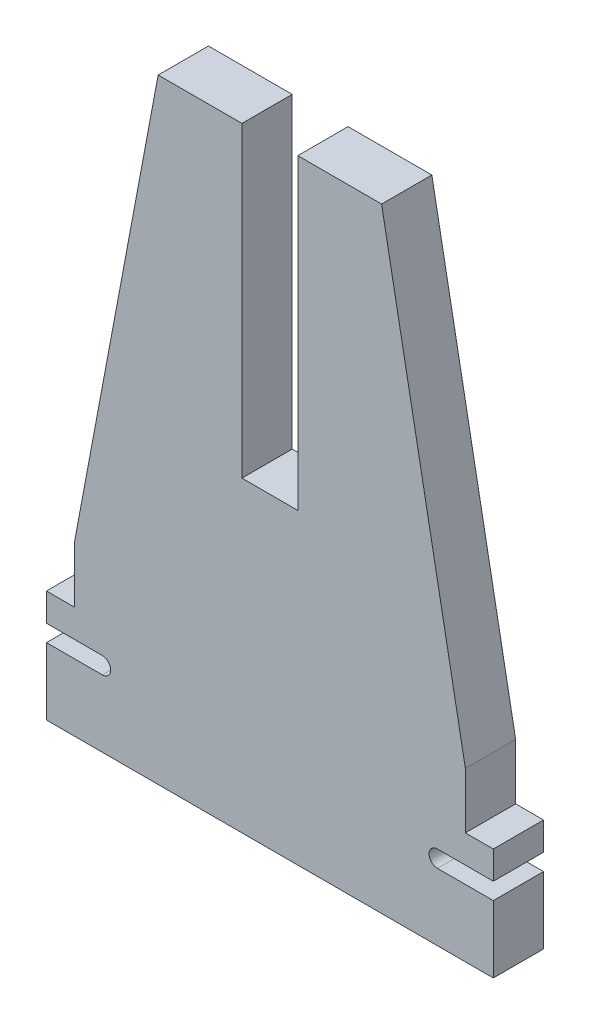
ISO-10303-21;
HEADER;
FILE_DESCRIPTION(('STEP AP214'),'2;1');
FILE_NAME('part.step','',(''),(''),'','','');
FILE_SCHEMA(('AUTOMOTIVE_DESIGN { 1 0 10303 214 1 1 1 1 }'));
ENDSEC;
DATA;
#1=APPLICATION_CONTEXT('core data for automotive mechanical design processes');
#2=APPLICATION_PROTOCOL_DEFINITION('international standard','automotive_design',2000,#1);
#3=PRODUCT_CONTEXT('',#1,'mechanical');
#4=PRODUCT('Part','Part','',(#3));
#5=PRODUCT_RELATED_PRODUCT_CATEGORY('part','',(#4));
#6=PRODUCT_DEFINITION_FORMATION('','',#4);
#7=PRODUCT_DEFINITION_CONTEXT('part definition',#1,'design');
#8=PRODUCT_DEFINITION('design','',#6,#7);
#9=PRODUCT_DEFINITION_SHAPE('','',#8);
#10=(LENGTH_UNIT() NAMED_UNIT(*) SI_UNIT(.MILLI.,.METRE.));
#11=(NAMED_UNIT(*) PLANE_ANGLE_UNIT() SI_UNIT($,.RADIAN.));
#12=(NAMED_UNIT(*) SI_UNIT($,.STERADIAN.) SOLID_ANGLE_UNIT());
#13=UNCERTAINTY_MEASURE_WITH_UNIT(LENGTH_MEASURE(1.E-05),#10,'distance_accuracy_value','');
#14=(GEOMETRIC_REPRESENTATION_CONTEXT(3) GLOBAL_UNCERTAINTY_ASSIGNED_CONTEXT((#13)) GLOBAL_UNIT_ASSIGNED_CONTEXT((#10,
#11,#12)) REPRESENTATION_CONTEXT('',''));
#15=CARTESIAN_POINT('',(0.,0.,0.));
#16=DIRECTION('',(0.,0.,1.));
#17=DIRECTION('',(1.,0.,0.));
#18=AXIS2_PLACEMENT_3D('',#15,#16,#17);
#19=CARTESIAN_POINT('',(-75.,20.,-9.));
#20=DIRECTION('',(-1.,0.,0.));
#21=DIRECTION('',(0.,0.,1.));
#22=AXIS2_PLACEMENT_3D('',#19,#20,#21);
#23=PLANE('',#22);
#24=DIRECTION('',(0.,0.,1.));
#25=VECTOR('',#24,1.);
#26=CARTESIAN_POINT('',(-75.,12.,-10.));
#27=LINE('',#26,#25);
#28=CARTESIAN_POINT('',(-75.,12.,-9.));
#29=VERTEX_POINT('',#28);
#30=CARTESIAN_POINT('',(-75.,12.,0.));
#31=VERTEX_POINT('',#30);
#32=EDGE_CURVE('E203',#29,#31,#27,.T.);
#33=ORIENTED_EDGE('',*,*,#32,.F.);
#34=DIRECTION('',(0.,-1.,0.));
#35=VECTOR('',#34,1.);
#36=CARTESIAN_POINT('',(-75.,20.,-9.));
#37=LINE('',#36,#35);
#38=CARTESIAN_POINT('',(-75.,0.,-9.));
#39=VERTEX_POINT('',#38);
#40=EDGE_CURVE('E242',#29,#39,#37,.T.);
#41=ORIENTED_EDGE('',*,*,#40,.T.);
#42=DIRECTION('',(0.,0.,1.));
#43=VECTOR('',#42,1.);
#44=CARTESIAN_POINT('',(-75.,0.,-9.));
#45=LINE('',#44,#43);
#46=CARTESIAN_POINT('',(-75.,0.,0.));
#47=VERTEX_POINT('',#46);
#48=EDGE_CURVE('E11',#39,#47,#45,.T.);
#49=ORIENTED_EDGE('',*,*,#48,.T.);
#50=DIRECTION('',(0.,-1.,0.));
#51=VECTOR('',#50,1.);
#52=CARTESIAN_POINT('',(-75.,20.,0.));
#53=LINE('',#52,#51);
#54=EDGE_CURVE('E211',#31,#47,#53,.T.);
#55=ORIENTED_EDGE('',*,*,#54,.F.);
#56=EDGE_LOOP('',(#33,#41,#49,#55));
#57=FACE_BOUND('',#56,.T.);
#58=ADVANCED_FACE('F33',(#57),#23,.T.);
#59=CARTESIAN_POINT('',(5.00000000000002,20.,-9.));
#60=DIRECTION('',(1.,0.,0.));
#61=DIRECTION('',(0.,1.,0.));
#62=AXIS2_PLACEMENT_3D('',#59,#60,#61);
#63=PLANE('',#62);
#64=DIRECTION('',(0.,0.,1.));
#65=VECTOR('',#64,1.);
#66=CARTESIAN_POINT('',(5.00000000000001,12.,-10.));
#67=LINE('',#66,#65);
#68=CARTESIAN_POINT('',(5.00000000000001,12.,-9.));
#69=VERTEX_POINT('',#68);
#70=CARTESIAN_POINT('',(5.00000000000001,12.,0.));
#71=VERTEX_POINT('',#70);
#72=EDGE_CURVE('E301',#69,#71,#67,.T.);
#73=ORIENTED_EDGE('',*,*,#72,.T.);
#74=DIRECTION('',(0.,1.,0.));
#75=VECTOR('',#74,1.);
#76=CARTESIAN_POINT('',(5.00000000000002,20.,0.));
#77=LINE('',#76,#75);
#78=CARTESIAN_POINT('',(5.00000000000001,0.,0.));
#79=VERTEX_POINT('',#78);
#80=EDGE_CURVE('E248',#79,#71,#77,.T.);
#81=ORIENTED_EDGE('',*,*,#80,.F.);
#82=DIRECTION('',(0.,0.,1.));
#83=VECTOR('',#82,1.);
#84=CARTESIAN_POINT('',(5.00000000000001,0.,-9.));
#85=LINE('',#84,#83);
#86=CARTESIAN_POINT('',(5.00000000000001,0.,-9.));
#87=VERTEX_POINT('',#86);
#88=EDGE_CURVE('E37',#87,#79,#85,.T.);
#89=ORIENTED_EDGE('',*,*,#88,.F.);
#90=DIRECTION('',(0.,1.,0.));
#91=VECTOR('',#90,1.);
#92=CARTESIAN_POINT('',(5.00000000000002,20.,-9.));
#93=LINE('',#92,#91);
#94=EDGE_CURVE('E346',#87,#69,#93,.T.);
#95=ORIENTED_EDGE('',*,*,#94,.T.);
#96=EDGE_LOOP('',(#73,#81,#89,#95));
#97=FACE_BOUND('',#96,.T.);
#98=ADVANCED_FACE('F410',(#97),#63,.T.);
#99=CARTESIAN_POINT('',(-15.,110.,-9.));
#100=DIRECTION('',(0.,1.,0.));
#101=DIRECTION('',(0.,0.,1.));
#102=AXIS2_PLACEMENT_3D('',#99,#100,#101);
#103=PLANE('',#102);
#104=DIRECTION('',(0.,0.,1.));
#105=VECTOR('',#104,1.);
#106=CARTESIAN_POINT('',(-40.,110.,-9.));
#107=LINE('',#106,#105);
#108=CARTESIAN_POINT('',(-40.,110.,-9.));
#109=VERTEX_POINT('',#108);
#110=CARTESIAN_POINT('',(-40.,110.,0.));
#111=VERTEX_POINT('',#110);
#112=EDGE_CURVE('E335',#109,#111,#107,.T.);
#113=ORIENTED_EDGE('',*,*,#112,.F.);
#114=DIRECTION('',(-1.,0.,0.));
#115=VECTOR('',#114,1.);
#116=CARTESIAN_POINT('',(-15.,110.,-9.));
#117=LINE('',#116,#115);
#118=CARTESIAN_POINT('',(-55.,110.,-9.));
#119=VERTEX_POINT('',#118);
#120=EDGE_CURVE('E358',#109,#119,#117,.T.);
#121=ORIENTED_EDGE('',*,*,#120,.T.);
#122=DIRECTION('',(0.,0.,1.));
#123=VECTOR('',#122,1.);
#124=CARTESIAN_POINT('',(-55.,110.,-9.));
#125=LINE('',#124,#123);
#126=CARTESIAN_POINT('',(-55.,110.,0.));
#127=VERTEX_POINT('',#126);
#128=EDGE_CURVE('E223',#119,#127,#125,.T.);
#129=ORIENTED_EDGE('',*,*,#128,.T.);
#130=DIRECTION('',(-1.,0.,0.));
#131=VECTOR('',#130,1.);
#132=CARTESIAN_POINT('',(-15.,110.,0.));
#133=LINE('',#132,#131);
#134=EDGE_CURVE('E261',#111,#127,#133,.T.);
#135=ORIENTED_EDGE('',*,*,#134,.F.);
#136=EDGE_LOOP('',(#113,#121,#129,#135));
#137=FACE_BOUND('',#136,.T.);
#138=ADVANCED_FACE('F371',(#137),#103,.T.);
#139=CARTESIAN_POINT('',(-75.,0.,-9.));
#140=DIRECTION('',(0.,-1.,0.));
#141=DIRECTION('',(0.,0.,-1.));
#142=AXIS2_PLACEMENT_3D('',#139,#140,#141);
#143=PLANE('',#142);
#144=DIRECTION('',(1.,0.,0.));
#145=VECTOR('',#144,1.);
#146=CARTESIAN_POINT('',(-75.,0.,0.));
#147=LINE('',#146,#145);
#148=EDGE_CURVE('E210',#47,#79,#147,.T.);
#149=ORIENTED_EDGE('',*,*,#148,.F.);
#150=ORIENTED_EDGE('',*,*,#48,.F.);
#151=DIRECTION('',(1.,0.,0.));
#152=VECTOR('',#151,1.);
#153=CARTESIAN_POINT('',(5.00000000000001,0.,-9.));
#154=LINE('',#153,#152);
#155=EDGE_CURVE('E213',#39,#87,#154,.T.);
#156=ORIENTED_EDGE('',*,*,#155,.T.);
#157=ORIENTED_EDGE('',*,*,#88,.T.);
#158=EDGE_LOOP('',(#149,#150,#156,#157));
#159=FACE_BOUND('',#158,.T.);
#160=ADVANCED_FACE('F413',(#159),#143,.T.);
#161=DIRECTION('',(0.,0.,1.));
#162=VECTOR('',#161,1.);
#163=CARTESIAN_POINT('',(-75.,15.,-10.));
#164=LINE('',#163,#162);
#165=CARTESIAN_POINT('',(-75.,15.,-9.));
#166=VERTEX_POINT('',#165);
#167=CARTESIAN_POINT('',(-75.,15.,0.));
#168=VERTEX_POINT('',#167);
#169=EDGE_CURVE('E188',#166,#168,#164,.T.);
#170=ORIENTED_EDGE('',*,*,#169,.T.);
#171=CARTESIAN_POINT('',(-75.,20.,0.));
#172=VERTEX_POINT('',#171);
#173=EDGE_CURVE('E199',#172,#168,#53,.T.);
#174=ORIENTED_EDGE('',*,*,#173,.F.);
#175=DIRECTION('',(0.,0.,1.));
#176=VECTOR('',#175,1.);
#177=CARTESIAN_POINT('',(-75.,20.,-9.));
#178=LINE('',#177,#176);
#179=CARTESIAN_POINT('',(-75.,20.,-9.));
#180=VERTEX_POINT('',#179);
#181=EDGE_CURVE('E42',#180,#172,#178,.T.);
#182=ORIENTED_EDGE('',*,*,#181,.F.);
#183=EDGE_CURVE('E202',#180,#166,#37,.T.);
#184=ORIENTED_EDGE('',*,*,#183,.T.);
#185=EDGE_LOOP('',(#170,#174,#182,#184));
#186=FACE_BOUND('',#185,.T.);
#187=ADVANCED_FACE('F198',(#186),#23,.T.);
#188=CARTESIAN_POINT('',(-69.9999999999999,20.,-9.));
#189=DIRECTION('',(0.,1.,0.));
#190=DIRECTION('',(0.,0.,1.));
#191=AXIS2_PLACEMENT_3D('',#188,#189,#190);
#192=PLANE('',#191);
#193=DIRECTION('',(-1.,0.,0.));
#194=VECTOR('',#193,1.);
#195=CARTESIAN_POINT('',(-69.9999999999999,20.,0.));
#196=LINE('',#195,#194);
#197=CARTESIAN_POINT('',(-69.9999999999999,20.,0.));
#198=VERTEX_POINT('',#197);
#199=EDGE_CURVE('E209',#198,#172,#196,.T.);
#200=ORIENTED_EDGE('',*,*,#199,.F.);
#201=DIRECTION('',(0.,0.,1.));
#202=VECTOR('',#201,1.);
#203=CARTESIAN_POINT('',(-69.9999999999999,20.,-9.));
#204=LINE('',#203,#202);
#205=CARTESIAN_POINT('',(-69.9999999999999,20.,-9.));
#206=VERTEX_POINT('',#205);
#207=EDGE_CURVE('E219',#206,#198,#204,.T.);
#208=ORIENTED_EDGE('',*,*,#207,.F.);
#209=DIRECTION('',(-1.,0.,0.));
#210=VECTOR('',#209,1.);
#211=CARTESIAN_POINT('',(-69.9999999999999,20.,-9.));
#212=LINE('',#211,#210);
#213=EDGE_CURVE('E244',#206,#180,#212,.T.);
#214=ORIENTED_EDGE('',*,*,#213,.T.);
#215=ORIENTED_EDGE('',*,*,#181,.T.);
#216=EDGE_LOOP('',(#200,#208,#214,#215));
#217=FACE_BOUND('',#216,.T.);
#218=ADVANCED_FACE('F278',(#217),#192,.T.);
#219=CARTESIAN_POINT('',(-69.9999999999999,30.,-9.));
#220=DIRECTION('',(-1.,0.,0.));
#221=DIRECTION('',(0.,0.,1.));
#222=AXIS2_PLACEMENT_3D('',#219,#220,#221);
#223=PLANE('',#222);
#224=DIRECTION('',(0.,-1.,0.));
#225=VECTOR('',#224,1.);
#226=CARTESIAN_POINT('',(-69.9999999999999,30.,0.));
#227=LINE('',#226,#225);
#228=CARTESIAN_POINT('',(-69.9999999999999,30.,0.));
#229=VERTEX_POINT('',#228);
#230=EDGE_CURVE('E267',#229,#198,#227,.T.);
#231=ORIENTED_EDGE('',*,*,#230,.F.);
#232=DIRECTION('',(0.,0.,1.));
#233=VECTOR('',#232,1.);
#234=CARTESIAN_POINT('',(-69.9999999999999,30.,-9.));
#235=LINE('',#234,#233);
#236=CARTESIAN_POINT('',(-69.9999999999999,30.,-9.));
#237=VERTEX_POINT('',#236);
#238=EDGE_CURVE('E221',#237,#229,#235,.T.);
#239=ORIENTED_EDGE('',*,*,#238,.F.);
#240=DIRECTION('',(0.,-1.,0.));
#241=VECTOR('',#240,1.);
#242=CARTESIAN_POINT('',(-69.9999999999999,30.,-9.));
#243=LINE('',#242,#241);
#244=EDGE_CURVE('E274',#237,#206,#243,.T.);
#245=ORIENTED_EDGE('',*,*,#244,.T.);
#246=ORIENTED_EDGE('',*,*,#207,.T.);
#247=EDGE_LOOP('',(#231,#239,#245,#246));
#248=FACE_BOUND('',#247,.T.);
#249=ADVANCED_FACE('F271',(#248),#223,.T.);
#250=CARTESIAN_POINT('',(-55.,110.,-9.));
#251=DIRECTION('',(-0.982872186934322,0.184288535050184,0.));
#252=DIRECTION('',(-0.184288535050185,-0.982872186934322,0.));
#253=AXIS2_PLACEMENT_3D('',#250,#251,#252);
#254=PLANE('',#253);
#255=DIRECTION('',(-0.184288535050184,-0.982872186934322,0.));
#256=VECTOR('',#255,1.);
#257=CARTESIAN_POINT('',(-55.,110.,0.));
#258=LINE('',#257,#256);
#259=EDGE_CURVE('E265',#127,#229,#258,.T.);
#260=ORIENTED_EDGE('',*,*,#259,.F.);
#261=ORIENTED_EDGE('',*,*,#128,.F.);
#262=DIRECTION('',(-0.184288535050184,-0.982872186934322,0.));
#263=VECTOR('',#262,1.);
#264=CARTESIAN_POINT('',(-55.,110.,-9.));
#265=LINE('',#264,#263);
#266=EDGE_CURVE('E362',#119,#237,#265,.T.);
#267=ORIENTED_EDGE('',*,*,#266,.T.);
#268=ORIENTED_EDGE('',*,*,#238,.T.);
#269=EDGE_LOOP('',(#260,#261,#267,#268));
#270=FACE_BOUND('',#269,.T.);
#271=ADVANCED_FACE('F367',(#270),#254,.T.);
#272=DIRECTION('',(0.,0.,1.));
#273=VECTOR('',#272,1.);
#274=CARTESIAN_POINT('',(-30.,110.,-9.));
#275=LINE('',#274,#273);
#276=CARTESIAN_POINT('',(-30.,110.,-9.));
#277=VERTEX_POINT('',#276);
#278=CARTESIAN_POINT('',(-30.,110.,0.));
#279=VERTEX_POINT('',#278);
#280=EDGE_CURVE('E337',#277,#279,#275,.T.);
#281=ORIENTED_EDGE('',*,*,#280,.T.);
#282=CARTESIAN_POINT('',(-15.,110.,0.));
#283=VERTEX_POINT('',#282);
#284=EDGE_CURVE('E262',#283,#279,#133,.T.);
#285=ORIENTED_EDGE('',*,*,#284,.F.);
#286=DIRECTION('',(0.,0.,1.));
#287=VECTOR('',#286,1.);
#288=CARTESIAN_POINT('',(-15.,110.,-9.));
#289=LINE('',#288,#287);
#290=CARTESIAN_POINT('',(-15.,110.,-9.));
#291=VERTEX_POINT('',#290);
#292=EDGE_CURVE('E226',#291,#283,#289,.T.);
#293=ORIENTED_EDGE('',*,*,#292,.F.);
#294=EDGE_CURVE('E359',#291,#277,#117,.T.);
#295=ORIENTED_EDGE('',*,*,#294,.T.);
#296=EDGE_LOOP('',(#281,#285,#293,#295));
#297=FACE_BOUND('',#296,.T.);
#298=ADVANCED_FACE('F386',(#297),#103,.T.);
#299=CARTESIAN_POINT('',(-15.,110.,-9.));
#300=DIRECTION('',(0.982872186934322,0.184288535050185,0.));
#301=DIRECTION('',(-0.184288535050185,0.982872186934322,0.));
#302=AXIS2_PLACEMENT_3D('',#299,#300,#301);
#303=PLANE('',#302);
#304=DIRECTION('',(-0.184288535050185,0.982872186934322,0.));
#305=VECTOR('',#304,1.);
#306=CARTESIAN_POINT('',(-15.,110.,0.));
#307=LINE('',#306,#305);
#308=CARTESIAN_POINT('',(0.,30.,0.));
#309=VERTEX_POINT('',#308);
#310=EDGE_CURVE('E258',#309,#283,#307,.T.);
#311=ORIENTED_EDGE('',*,*,#310,.F.);
#312=DIRECTION('',(0.,0.,1.));
#313=VECTOR('',#312,1.);
#314=CARTESIAN_POINT('',(0.,30.,-9.));
#315=LINE('',#314,#313);
#316=CARTESIAN_POINT('',(0.,30.,-9.));
#317=VERTEX_POINT('',#316);
#318=EDGE_CURVE('E228',#317,#309,#315,.T.);
#319=ORIENTED_EDGE('',*,*,#318,.F.);
#320=DIRECTION('',(-0.184288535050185,0.982872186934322,0.));
#321=VECTOR('',#320,1.);
#322=CARTESIAN_POINT('',(-15.,110.,-9.));
#323=LINE('',#322,#321);
#324=EDGE_CURVE('E355',#317,#291,#323,.T.);
#325=ORIENTED_EDGE('',*,*,#324,.T.);
#326=ORIENTED_EDGE('',*,*,#292,.T.);
#327=EDGE_LOOP('',(#311,#319,#325,#326));
#328=FACE_BOUND('',#327,.T.);
#329=ADVANCED_FACE('F390',(#328),#303,.T.);
#330=CARTESIAN_POINT('',(0.,20.,-9.));
#331=DIRECTION('',(1.,0.,0.));
#332=DIRECTION('',(0.,1.,0.));
#333=AXIS2_PLACEMENT_3D('',#330,#331,#332);
#334=PLANE('',#333);
#335=DIRECTION('',(0.,1.,0.));
#336=VECTOR('',#335,1.);
#337=CARTESIAN_POINT('',(0.,20.,0.));
#338=LINE('',#337,#336);
#339=CARTESIAN_POINT('',(0.,20.,0.));
#340=VERTEX_POINT('',#339);
#341=EDGE_CURVE('E255',#340,#309,#338,.T.);
#342=ORIENTED_EDGE('',*,*,#341,.F.);
#343=DIRECTION('',(0.,0.,1.));
#344=VECTOR('',#343,1.);
#345=CARTESIAN_POINT('',(0.,20.,-9.));
#346=LINE('',#345,#344);
#347=CARTESIAN_POINT('',(0.,20.,-9.));
#348=VERTEX_POINT('',#347);
#349=EDGE_CURVE('E230',#348,#340,#346,.T.);
#350=ORIENTED_EDGE('',*,*,#349,.F.);
#351=DIRECTION('',(0.,1.,0.));
#352=VECTOR('',#351,1.);
#353=CARTESIAN_POINT('',(0.,20.,-9.));
#354=LINE('',#353,#352);
#355=EDGE_CURVE('E352',#348,#317,#354,.T.);
#356=ORIENTED_EDGE('',*,*,#355,.T.);
#357=ORIENTED_EDGE('',*,*,#318,.T.);
#358=EDGE_LOOP('',(#342,#350,#356,#357));
#359=FACE_BOUND('',#358,.T.);
#360=ADVANCED_FACE('F395',(#359),#334,.T.);
#361=CARTESIAN_POINT('',(0.,20.,-9.));
#362=DIRECTION('',(0.,1.,0.));
#363=DIRECTION('',(-1.,0.,0.));
#364=AXIS2_PLACEMENT_3D('',#361,#362,#363);
#365=PLANE('',#364);
#366=DIRECTION('',(-1.,0.,0.));
#367=VECTOR('',#366,1.);
#368=CARTESIAN_POINT('',(0.,20.,0.));
#369=LINE('',#368,#367);
#370=CARTESIAN_POINT('',(5.00000000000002,20.,0.));
#371=VERTEX_POINT('',#370);
#372=EDGE_CURVE('E251',#371,#340,#369,.T.);
#373=ORIENTED_EDGE('',*,*,#372,.F.);
#374=DIRECTION('',(0.,0.,1.));
#375=VECTOR('',#374,1.);
#376=CARTESIAN_POINT('',(5.00000000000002,20.,-9.));
#377=LINE('',#376,#375);
#378=CARTESIAN_POINT('',(5.00000000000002,20.,-9.));
#379=VERTEX_POINT('',#378);
#380=EDGE_CURVE('E231',#379,#371,#377,.T.);
#381=ORIENTED_EDGE('',*,*,#380,.F.);
#382=DIRECTION('',(-1.,0.,0.));
#383=VECTOR('',#382,1.);
#384=CARTESIAN_POINT('',(0.,20.,-9.));
#385=LINE('',#384,#383);
#386=EDGE_CURVE('E349',#379,#348,#385,.T.);
#387=ORIENTED_EDGE('',*,*,#386,.T.);
#388=ORIENTED_EDGE('',*,*,#349,.T.);
#389=EDGE_LOOP('',(#373,#381,#387,#388));
#390=FACE_BOUND('',#389,.T.);
#391=ADVANCED_FACE('F397',(#390),#365,.T.);
#392=DIRECTION('',(0.,0.,1.));
#393=VECTOR('',#392,1.);
#394=CARTESIAN_POINT('',(5.00000000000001,15.,-10.));
#395=LINE('',#394,#393);
#396=CARTESIAN_POINT('',(5.00000000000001,15.,-9.));
#397=VERTEX_POINT('',#396);
#398=CARTESIAN_POINT('',(5.00000000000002,15.,0.));
#399=VERTEX_POINT('',#398);
#400=EDGE_CURVE('E58',#397,#399,#395,.T.);
#401=ORIENTED_EDGE('',*,*,#400,.F.);
#402=EDGE_CURVE('E345',#397,#379,#93,.T.);
#403=ORIENTED_EDGE('',*,*,#402,.T.);
#404=ORIENTED_EDGE('',*,*,#380,.T.);
#405=EDGE_CURVE('E252',#399,#371,#77,.T.);
#406=ORIENTED_EDGE('',*,*,#405,.F.);
#407=EDGE_LOOP('',(#401,#403,#404,#406));
#408=FACE_BOUND('',#407,.T.);
#409=ADVANCED_FACE('F35',(#408),#63,.T.);
#410=CARTESIAN_POINT('',(-75.,0.,-9.));
#411=DIRECTION('',(0.,0.,1.));
#412=DIRECTION('',(1.,0.,0.));
#413=AXIS2_PLACEMENT_3D('',#410,#411,#412);
#414=PLANE('',#413);
#415=ORIENTED_EDGE('',*,*,#40,.F.);
#416=DIRECTION('',(1.,0.,0.));
#417=VECTOR('',#416,1.);
#418=CARTESIAN_POINT('',(-75.,12.,-9.));
#419=LINE('',#418,#417);
#420=CARTESIAN_POINT('',(-65.,12.,-9.));
#421=VERTEX_POINT('',#420);
#422=EDGE_CURVE('E286',#29,#421,#419,.T.);
#423=ORIENTED_EDGE('',*,*,#422,.T.);
#424=CARTESIAN_POINT('',(-65.,13.5,-9.));
#425=DIRECTION('',(0.,0.,1.));
#426=DIRECTION('',(1.,0.,0.));
#427=AXIS2_PLACEMENT_3D('',#424,#425,#426);
#428=CIRCLE('',#427,1.5);
#429=CARTESIAN_POINT('',(-65.,15.,-9.));
#430=VERTEX_POINT('',#429);
#431=EDGE_CURVE('E285',#421,#430,#428,.T.);
#432=ORIENTED_EDGE('',*,*,#431,.T.);
#433=DIRECTION('',(-1.,0.,0.));
#434=VECTOR('',#433,1.);
#435=CARTESIAN_POINT('',(-75.,15.,-9.));
#436=LINE('',#435,#434);
#437=EDGE_CURVE('E283',#430,#166,#436,.T.);
#438=ORIENTED_EDGE('',*,*,#437,.T.);
#439=ORIENTED_EDGE('',*,*,#183,.F.);
#440=ORIENTED_EDGE('',*,*,#213,.F.);
#441=ORIENTED_EDGE('',*,*,#244,.F.);
#442=ORIENTED_EDGE('',*,*,#266,.F.);
#443=ORIENTED_EDGE('',*,*,#120,.F.);
#444=DIRECTION('',(0.,-1.,0.));
#445=VECTOR('',#444,1.);
#446=CARTESIAN_POINT('',(-40.,110.,-9.));
#447=LINE('',#446,#445);
#448=CARTESIAN_POINT('',(-40.,55.,-9.));
#449=VERTEX_POINT('',#448);
#450=EDGE_CURVE('E319',#109,#449,#447,.T.);
#451=ORIENTED_EDGE('',*,*,#450,.T.);
#452=DIRECTION('',(1.,0.,0.));
#453=VECTOR('',#452,1.);
#454=CARTESIAN_POINT('',(-40.,55.,-9.));
#455=LINE('',#454,#453);
#456=CARTESIAN_POINT('',(-30.,55.,-9.));
#457=VERTEX_POINT('',#456);
#458=EDGE_CURVE('E322',#449,#457,#455,.T.);
#459=ORIENTED_EDGE('',*,*,#458,.T.);
#460=DIRECTION('',(0.,1.,0.));
#461=VECTOR('',#460,1.);
#462=CARTESIAN_POINT('',(-30.,110.,-9.));
#463=LINE('',#462,#461);
#464=EDGE_CURVE('E326',#457,#277,#463,.T.);
#465=ORIENTED_EDGE('',*,*,#464,.T.);
#466=ORIENTED_EDGE('',*,*,#294,.F.);
#467=ORIENTED_EDGE('',*,*,#324,.F.);
#468=ORIENTED_EDGE('',*,*,#355,.F.);
#469=ORIENTED_EDGE('',*,*,#386,.F.);
#470=ORIENTED_EDGE('',*,*,#402,.F.);
#471=DIRECTION('',(-1.,0.,0.));
#472=VECTOR('',#471,1.);
#473=CARTESIAN_POINT('',(-75.,15.,-9.));
#474=LINE('',#473,#472);
#475=CARTESIAN_POINT('',(-4.99999999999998,15.,-9.));
#476=VERTEX_POINT('',#475);
#477=EDGE_CURVE('E304',#397,#476,#474,.T.);
#478=ORIENTED_EDGE('',*,*,#477,.T.);
#479=CARTESIAN_POINT('',(-4.99999999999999,13.5,-9.));
#480=DIRECTION('',(0.,0.,1.));
#481=DIRECTION('',(1.,0.,0.));
#482=AXIS2_PLACEMENT_3D('',#479,#480,#481);
#483=CIRCLE('',#482,1.5);
#484=CARTESIAN_POINT('',(-4.99999999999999,12.,-9.));
#485=VERTEX_POINT('',#484);
#486=EDGE_CURVE('E312',#476,#485,#483,.T.);
#487=ORIENTED_EDGE('',*,*,#486,.T.);
#488=DIRECTION('',(1.,0.,0.));
#489=VECTOR('',#488,1.);
#490=CARTESIAN_POINT('',(-75.,12.,-9.));
#491=LINE('',#490,#489);
#492=EDGE_CURVE('E315',#485,#69,#491,.T.);
#493=ORIENTED_EDGE('',*,*,#492,.T.);
#494=ORIENTED_EDGE('',*,*,#94,.F.);
#495=ORIENTED_EDGE('',*,*,#155,.F.);
#496=EDGE_LOOP('',(#415,#423,#432,#438,#439,#440,#441,#442,#443,#451,#459,#465,#466,#467,#468,
#469,#470,#478,#487,#493,#494,#495));
#497=FACE_BOUND('',#496,.T.);
#498=ADVANCED_FACE('F281',(#497),#414,.F.);
#499=CARTESIAN_POINT('',(-75.,0.,0.));
#500=DIRECTION('',(0.,0.,1.));
#501=DIRECTION('',(1.,0.,0.));
#502=AXIS2_PLACEMENT_3D('',#499,#500,#501);
#503=PLANE('',#502);
#504=DIRECTION('',(1.,0.,0.));
#505=VECTOR('',#504,1.);
#506=CARTESIAN_POINT('',(-65.,12.,0.));
#507=LINE('',#506,#505);
#508=CARTESIAN_POINT('',(-65.,12.,0.));
#509=VERTEX_POINT('',#508);
#510=EDGE_CURVE('E193',#31,#509,#507,.T.);
#511=ORIENTED_EDGE('',*,*,#510,.F.);
#512=ORIENTED_EDGE('',*,*,#54,.T.);
#513=ORIENTED_EDGE('',*,*,#148,.T.);
#514=ORIENTED_EDGE('',*,*,#80,.T.);
#515=DIRECTION('',(1.,0.,0.));
#516=VECTOR('',#515,1.);
#517=CARTESIAN_POINT('',(-4.99999999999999,12.,0.));
#518=LINE('',#517,#516);
#519=CARTESIAN_POINT('',(-4.99999999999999,12.,0.));
#520=VERTEX_POINT('',#519);
#521=EDGE_CURVE('E299',#520,#71,#518,.T.);
#522=ORIENTED_EDGE('',*,*,#521,.F.);
#523=CARTESIAN_POINT('',(-4.99999999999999,13.5,0.));
#524=DIRECTION('',(0.,0.,1.));
#525=DIRECTION('',(1.,0.,0.));
#526=AXIS2_PLACEMENT_3D('',#523,#524,#525);
#527=CIRCLE('',#526,1.5);
#528=CARTESIAN_POINT('',(-4.99999999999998,15.,0.));
#529=VERTEX_POINT('',#528);
#530=EDGE_CURVE('E296',#529,#520,#527,.T.);
#531=ORIENTED_EDGE('',*,*,#530,.F.);
#532=DIRECTION('',(-1.,0.,0.));
#533=VECTOR('',#532,1.);
#534=CARTESIAN_POINT('',(5.00000000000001,15.,0.));
#535=LINE('',#534,#533);
#536=EDGE_CURVE('E294',#399,#529,#535,.T.);
#537=ORIENTED_EDGE('',*,*,#536,.F.);
#538=ORIENTED_EDGE('',*,*,#405,.T.);
#539=ORIENTED_EDGE('',*,*,#372,.T.);
#540=ORIENTED_EDGE('',*,*,#341,.T.);
#541=ORIENTED_EDGE('',*,*,#310,.T.);
#542=ORIENTED_EDGE('',*,*,#284,.T.);
#543=DIRECTION('',(0.,1.,0.));
#544=VECTOR('',#543,1.);
#545=CARTESIAN_POINT('',(-30.,110.,0.));
#546=LINE('',#545,#544);
#547=CARTESIAN_POINT('',(-30.,55.,0.));
#548=VERTEX_POINT('',#547);
#549=EDGE_CURVE('E323',#548,#279,#546,.T.);
#550=ORIENTED_EDGE('',*,*,#549,.F.);
#551=DIRECTION('',(1.,0.,0.));
#552=VECTOR('',#551,1.);
#553=CARTESIAN_POINT('',(-40.,55.,0.));
#554=LINE('',#553,#552);
#555=CARTESIAN_POINT('',(-40.,55.,0.));
#556=VERTEX_POINT('',#555);
#557=EDGE_CURVE('E331',#556,#548,#554,.T.);
#558=ORIENTED_EDGE('',*,*,#557,.F.);
#559=DIRECTION('',(0.,-1.,0.));
#560=VECTOR('',#559,1.);
#561=CARTESIAN_POINT('',(-40.,110.,0.));
#562=LINE('',#561,#560);
#563=EDGE_CURVE('E318',#111,#556,#562,.T.);
#564=ORIENTED_EDGE('',*,*,#563,.F.);
#565=ORIENTED_EDGE('',*,*,#134,.T.);
#566=ORIENTED_EDGE('',*,*,#259,.T.);
#567=ORIENTED_EDGE('',*,*,#230,.T.);
#568=ORIENTED_EDGE('',*,*,#199,.T.);
#569=ORIENTED_EDGE('',*,*,#173,.T.);
#570=DIRECTION('',(-1.,0.,0.));
#571=VECTOR('',#570,1.);
#572=CARTESIAN_POINT('',(-75.,15.,0.));
#573=LINE('',#572,#571);
#574=CARTESIAN_POINT('',(-65.,15.,0.));
#575=VERTEX_POINT('',#574);
#576=EDGE_CURVE('E185',#575,#168,#573,.T.);
#577=ORIENTED_EDGE('',*,*,#576,.F.);
#578=CARTESIAN_POINT('',(-65.,13.5,0.));
#579=DIRECTION('',(0.,0.,1.));
#580=DIRECTION('',(-1.,0.,0.));
#581=AXIS2_PLACEMENT_3D('',#578,#579,#580);
#582=CIRCLE('',#581,1.5);
#583=EDGE_CURVE('E50',#509,#575,#582,.T.);
#584=ORIENTED_EDGE('',*,*,#583,.F.);
#585=EDGE_LOOP('',(#511,#512,#513,#514,#522,#531,#537,#538,#539,#540,#541,#542,#550,#558,#564,
#565,#566,#567,#568,#569,#577,#584));
#586=FACE_BOUND('',#585,.T.);
#587=ADVANCED_FACE('F206',(#586),#503,.T.);
#588=CARTESIAN_POINT('',(-40.,110.,-9.));
#589=DIRECTION('',(-1.,0.,0.));
#590=DIRECTION('',(0.,-1.,0.));
#591=AXIS2_PLACEMENT_3D('',#588,#589,#590);
#592=PLANE('',#591);
#593=ORIENTED_EDGE('',*,*,#563,.T.);
#594=DIRECTION('',(0.,0.,1.));
#595=VECTOR('',#594,1.);
#596=CARTESIAN_POINT('',(-40.,55.,-9.));
#597=LINE('',#596,#595);
#598=EDGE_CURVE('E329',#449,#556,#597,.T.);
#599=ORIENTED_EDGE('',*,*,#598,.F.);
#600=ORIENTED_EDGE('',*,*,#450,.F.);
#601=ORIENTED_EDGE('',*,*,#112,.T.);
#602=EDGE_LOOP('',(#593,#599,#600,#601));
#603=FACE_BOUND('',#602,.T.);
#604=ADVANCED_FACE('F375',(#603),#592,.F.);
#605=CARTESIAN_POINT('',(-30.,110.,-9.));
#606=DIRECTION('',(1.,0.,0.));
#607=DIRECTION('',(0.,1.,0.));
#608=AXIS2_PLACEMENT_3D('',#605,#606,#607);
#609=PLANE('',#608);
#610=ORIENTED_EDGE('',*,*,#549,.T.);
#611=ORIENTED_EDGE('',*,*,#280,.F.);
#612=ORIENTED_EDGE('',*,*,#464,.F.);
#613=DIRECTION('',(0.,0.,1.));
#614=VECTOR('',#613,1.);
#615=CARTESIAN_POINT('',(-30.,55.,-9.));
#616=LINE('',#615,#614);
#617=EDGE_CURVE('E340',#457,#548,#616,.T.);
#618=ORIENTED_EDGE('',*,*,#617,.T.);
#619=EDGE_LOOP('',(#610,#611,#612,#618));
#620=FACE_BOUND('',#619,.T.);
#621=ADVANCED_FACE('F457',(#620),#609,.F.);
#622=CARTESIAN_POINT('',(-40.,55.,-9.));
#623=DIRECTION('',(0.,-1.,0.));
#624=DIRECTION('',(0.,0.,-1.));
#625=AXIS2_PLACEMENT_3D('',#622,#623,#624);
#626=PLANE('',#625);
#627=ORIENTED_EDGE('',*,*,#557,.T.);
#628=ORIENTED_EDGE('',*,*,#617,.F.);
#629=ORIENTED_EDGE('',*,*,#458,.F.);
#630=ORIENTED_EDGE('',*,*,#598,.T.);
#631=EDGE_LOOP('',(#627,#628,#629,#630));
#632=FACE_BOUND('',#631,.T.);
#633=ADVANCED_FACE('F379',(#632),#626,.F.);
#634=CARTESIAN_POINT('',(-4.99999999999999,12.,-10.));
#635=DIRECTION('',(0.,-1.,0.));
#636=DIRECTION('',(0.,0.,-1.));
#637=AXIS2_PLACEMENT_3D('',#634,#635,#636);
#638=PLANE('',#637);
#639=DIRECTION('',(0.,0.,1.));
#640=VECTOR('',#639,1.);
#641=CARTESIAN_POINT('',(-4.99999999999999,12.,-10.));
#642=LINE('',#641,#640);
#643=EDGE_CURVE('E305',#485,#520,#642,.T.);
#644=ORIENTED_EDGE('',*,*,#643,.T.);
#645=ORIENTED_EDGE('',*,*,#521,.T.);
#646=ORIENTED_EDGE('',*,*,#72,.F.);
#647=ORIENTED_EDGE('',*,*,#492,.F.);
#648=EDGE_LOOP('',(#644,#645,#646,#647));
#649=FACE_BOUND('',#648,.T.);
#650=ADVANCED_FACE('F460',(#649),#638,.F.);
#651=CARTESIAN_POINT('',(-4.99999999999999,13.5,-10.));
#652=DIRECTION('',(0.,0.,1.));
#653=DIRECTION('',(1.,0.,0.));
#654=AXIS2_PLACEMENT_3D('',#651,#652,#653);
#655=CYLINDRICAL_SURFACE('',#654,1.5);
#656=DIRECTION('',(0.,0.,1.));
#657=VECTOR('',#656,1.);
#658=CARTESIAN_POINT('',(-4.99999999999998,15.,-10.));
#659=LINE('',#658,#657);
#660=EDGE_CURVE('E307',#476,#529,#659,.T.);
#661=ORIENTED_EDGE('',*,*,#660,.T.);
#662=ORIENTED_EDGE('',*,*,#530,.T.);
#663=ORIENTED_EDGE('',*,*,#643,.F.);
#664=ORIENTED_EDGE('',*,*,#486,.F.);
#665=EDGE_LOOP('',(#661,#662,#663,#664));
#666=FACE_BOUND('',#665,.T.);
#667=ADVANCED_FACE('F404',(#666),#655,.F.);
#668=CARTESIAN_POINT('',(5.00000000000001,15.,-10.));
#669=DIRECTION('',(0.,1.,0.));
#670=DIRECTION('',(0.,0.,1.));
#671=AXIS2_PLACEMENT_3D('',#668,#669,#670);
#672=PLANE('',#671);
#673=ORIENTED_EDGE('',*,*,#400,.T.);
#674=ORIENTED_EDGE('',*,*,#536,.T.);
#675=ORIENTED_EDGE('',*,*,#660,.F.);
#676=ORIENTED_EDGE('',*,*,#477,.F.);
#677=EDGE_LOOP('',(#673,#674,#675,#676));
#678=FACE_BOUND('',#677,.T.);
#679=ADVANCED_FACE('F402',(#678),#672,.F.);
#680=CARTESIAN_POINT('',(-65.,13.5,-10.));
#681=DIRECTION('',(0.,0.,1.));
#682=DIRECTION('',(1.,0.,0.));
#683=AXIS2_PLACEMENT_3D('',#680,#681,#682);
#684=CYLINDRICAL_SURFACE('',#683,1.5);
#685=DIRECTION('',(0.,0.,1.));
#686=VECTOR('',#685,1.);
#687=CARTESIAN_POINT('',(-65.,12.,-10.));
#688=LINE('',#687,#686);
#689=EDGE_CURVE('E287',#421,#509,#688,.T.);
#690=ORIENTED_EDGE('',*,*,#689,.T.);
#691=ORIENTED_EDGE('',*,*,#583,.T.);
#692=DIRECTION('',(0.,0.,1.));
#693=VECTOR('',#692,1.);
#694=CARTESIAN_POINT('',(-65.,15.,-10.));
#695=LINE('',#694,#693);
#696=EDGE_CURVE('E190',#430,#575,#695,.T.);
#697=ORIENTED_EDGE('',*,*,#696,.F.);
#698=ORIENTED_EDGE('',*,*,#431,.F.);
#699=EDGE_LOOP('',(#690,#691,#697,#698));
#700=FACE_BOUND('',#699,.T.);
#701=ADVANCED_FACE('F420',(#700),#684,.F.);
#702=CARTESIAN_POINT('',(-65.,12.,-10.));
#703=DIRECTION('',(0.,-1.,0.));
#704=DIRECTION('',(0.,0.,-1.));
#705=AXIS2_PLACEMENT_3D('',#702,#703,#704);
#706=PLANE('',#705);
#707=ORIENTED_EDGE('',*,*,#32,.T.);
#708=ORIENTED_EDGE('',*,*,#510,.T.);
#709=ORIENTED_EDGE('',*,*,#689,.F.);
#710=ORIENTED_EDGE('',*,*,#422,.F.);
#711=EDGE_LOOP('',(#707,#708,#709,#710));
#712=FACE_BOUND('',#711,.T.);
#713=ADVANCED_FACE('F418',(#712),#706,.F.);
#714=CARTESIAN_POINT('',(-75.,15.,-10.));
#715=DIRECTION('',(0.,1.,0.));
#716=DIRECTION('',(0.,0.,1.));
#717=AXIS2_PLACEMENT_3D('',#714,#715,#716);
#718=PLANE('',#717);
#719=ORIENTED_EDGE('',*,*,#696,.T.);
#720=ORIENTED_EDGE('',*,*,#576,.T.);
#721=ORIENTED_EDGE('',*,*,#169,.F.);
#722=ORIENTED_EDGE('',*,*,#437,.F.);
#723=EDGE_LOOP('',(#719,#720,#721,#722));
#724=FACE_BOUND('',#723,.T.);
#725=ADVANCED_FACE('F187',(#724),#718,.F.);
#726=CLOSED_SHELL('',(#58,#98,#138,#160,#187,#218,#249,#271,#298,#329,#360,#391,#409,#498,#587,
#604,#621,#633,#650,#667,#679,#701,#713,#725));
#727=MANIFOLD_SOLID_BREP('B2',#726);
#728=ADVANCED_BREP_SHAPE_REPRESENTATION('',(#18,#727),#14);
#729=SHAPE_DEFINITION_REPRESENTATION(#9,#728);
ENDSEC;
END-ISO-10303-21;
